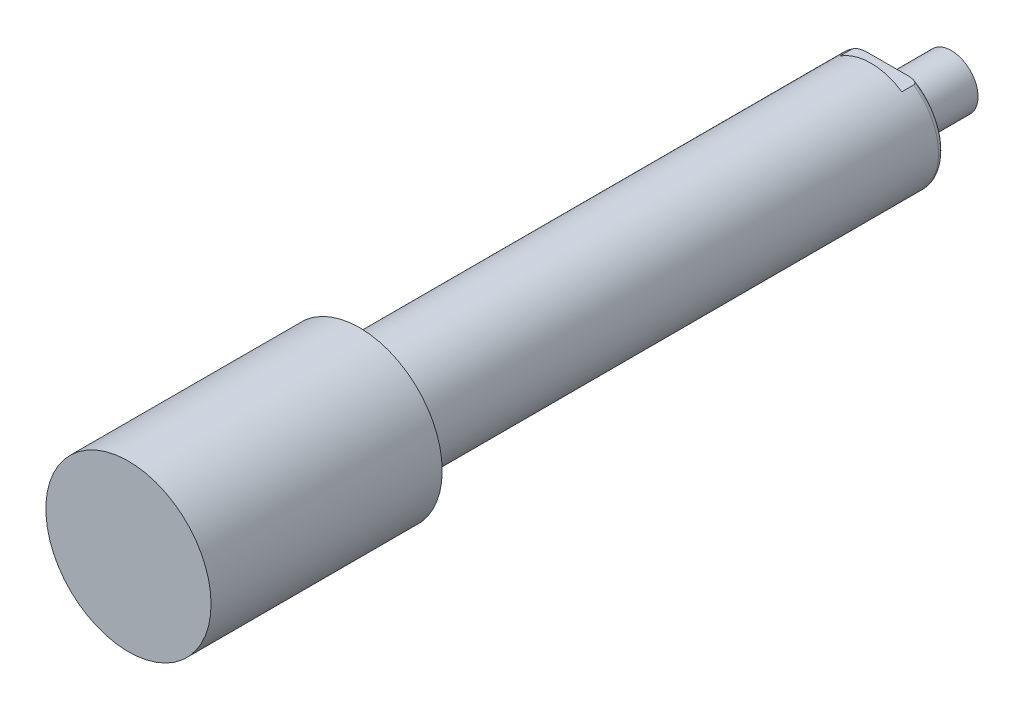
ISO-10303-21;
HEADER;
FILE_DESCRIPTION(('STEP AP214'),'2;1');
FILE_NAME('part.step','',(''),(''),'','','');
FILE_SCHEMA(('AUTOMOTIVE_DESIGN { 1 0 10303 214 1 1 1 1 }'));
ENDSEC;
DATA;
#1=APPLICATION_CONTEXT('core data for automotive mechanical design processes');
#2=APPLICATION_PROTOCOL_DEFINITION('international standard','automotive_design',2000,#1);
#3=PRODUCT_CONTEXT('',#1,'mechanical');
#4=PRODUCT('Part','Part','',(#3));
#5=PRODUCT_RELATED_PRODUCT_CATEGORY('part','',(#4));
#6=PRODUCT_DEFINITION_FORMATION('','',#4);
#7=PRODUCT_DEFINITION_CONTEXT('part definition',#1,'design');
#8=PRODUCT_DEFINITION('design','',#6,#7);
#9=PRODUCT_DEFINITION_SHAPE('','',#8);
#10=(LENGTH_UNIT() NAMED_UNIT(*) SI_UNIT(.MILLI.,.METRE.));
#11=(NAMED_UNIT(*) PLANE_ANGLE_UNIT() SI_UNIT($,.RADIAN.));
#12=(NAMED_UNIT(*) SI_UNIT($,.STERADIAN.) SOLID_ANGLE_UNIT());
#13=UNCERTAINTY_MEASURE_WITH_UNIT(LENGTH_MEASURE(1.E-05),#10,'distance_accuracy_value','');
#14=(GEOMETRIC_REPRESENTATION_CONTEXT(3) GLOBAL_UNCERTAINTY_ASSIGNED_CONTEXT((#13)) GLOBAL_UNIT_ASSIGNED_CONTEXT((#10,
#11,#12)) REPRESENTATION_CONTEXT('',''));
#15=CARTESIAN_POINT('',(0.,0.,0.));
#16=DIRECTION('',(0.,0.,1.));
#17=DIRECTION('',(1.,0.,0.));
#18=AXIS2_PLACEMENT_3D('',#15,#16,#17);
#19=CARTESIAN_POINT('',(0.,0.,41.62));
#20=DIRECTION('',(0.,0.,1.));
#21=DIRECTION('',(1.,0.,0.));
#22=AXIS2_PLACEMENT_3D('',#19,#20,#21);
#23=PLANE('',#22);
#24=CARTESIAN_POINT('',(0.,0.,41.62));
#25=DIRECTION('',(0.,0.,1.));
#26=DIRECTION('',(1.,0.,0.));
#27=AXIS2_PLACEMENT_3D('',#24,#25,#26);
#28=CIRCLE('',#27,24.765);
#29=CARTESIAN_POINT('',(24.765,0.,41.62));
#30=VERTEX_POINT('',#29);
#31=EDGE_CURVE('E149',#30,#30,#28,.T.);
#32=ORIENTED_EDGE('',*,*,#31,.T.);
#33=EDGE_LOOP('',(#32));
#34=FACE_BOUND('',#33,.T.);
#35=ADVANCED_FACE('F16',(#34),#23,.T.);
#36=CARTESIAN_POINT('',(0.,0.,13.045));
#37=DIRECTION('',(0.,0.,1.));
#38=DIRECTION('',(1.,0.,0.));
#39=AXIS2_PLACEMENT_3D('',#36,#37,#38);
#40=CYLINDRICAL_SURFACE('',#39,24.765);
#41=CARTESIAN_POINT('',(0.,0.,-27.686));
#42=DIRECTION('',(0.,0.,-1.));
#43=DIRECTION('',(-1.,0.,0.));
#44=AXIS2_PLACEMENT_3D('',#41,#42,#43);
#45=CIRCLE('',#44,24.765);
#46=CARTESIAN_POINT('',(-24.765,0.,-27.686));
#47=VERTEX_POINT('',#46);
#48=EDGE_CURVE('E151',#47,#47,#45,.T.);
#49=ORIENTED_EDGE('',*,*,#48,.F.);
#50=EDGE_LOOP('',(#49));
#51=FACE_BOUND('',#50,.T.);
#52=ORIENTED_EDGE('',*,*,#31,.F.);
#53=EDGE_LOOP('',(#52));
#54=FACE_BOUND('',#53,.T.);
#55=ADVANCED_FACE('F18',(#51,#54),#40,.T.);
#56=CARTESIAN_POINT('',(0.,0.,-27.686));
#57=DIRECTION('',(0.,0.,-1.));
#58=DIRECTION('',(-1.,0.,0.));
#59=AXIS2_PLACEMENT_3D('',#56,#57,#58);
#60=PLANE('',#59);
#61=CARTESIAN_POINT('',(0.,0.,-27.686));
#62=DIRECTION('',(0.,0.,-1.));
#63=DIRECTION('',(-1.,0.,0.));
#64=AXIS2_PLACEMENT_3D('',#61,#62,#63);
#65=CIRCLE('',#64,16.8);
#66=CARTESIAN_POINT('',(-16.8,0.,-27.686));
#67=VERTEX_POINT('',#66);
#68=EDGE_CURVE('E20',#67,#67,#65,.F.);
#69=ORIENTED_EDGE('',*,*,#68,.T.);
#70=EDGE_LOOP('',(#69));
#71=FACE_BOUND('',#70,.T.);
#72=ORIENTED_EDGE('',*,*,#48,.T.);
#73=EDGE_LOOP('',(#72));
#74=FACE_BOUND('',#73,.T.);
#75=ADVANCED_FACE('F158',(#71,#74),#60,.T.);
#76=CARTESIAN_POINT('',(0.,8.,-205.11539999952));
#77=DIRECTION('',(0.,0.,-1.));
#78=DIRECTION('',(-1.,0.,0.));
#79=AXIS2_PLACEMENT_3D('',#76,#77,#78);
#80=PLANE('',#79);
#81=CARTESIAN_POINT('',(0.,0.,-205.11539999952));
#82=DIRECTION('',(0.,0.,-1.));
#83=DIRECTION('',(-1.,0.,0.));
#84=AXIS2_PLACEMENT_3D('',#81,#82,#83);
#85=CIRCLE('',#84,8.);
#86=CARTESIAN_POINT('',(-8.,0.,-205.11539999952));
#87=VERTEX_POINT('',#86);
#88=EDGE_CURVE('E129',#87,#87,#85,.T.);
#89=ORIENTED_EDGE('',*,*,#88,.T.);
#90=EDGE_LOOP('',(#89));
#91=FACE_BOUND('',#90,.T.);
#92=ADVANCED_FACE('F117',(#91),#80,.T.);
#93=CARTESIAN_POINT('',(0.,0.,-205.11539999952));
#94=DIRECTION('',(0.,0.,-1.));
#95=DIRECTION('',(-1.,0.,0.));
#96=AXIS2_PLACEMENT_3D('',#93,#94,#95);
#97=CYLINDRICAL_SURFACE('',#96,8.);
#98=CARTESIAN_POINT('',(0.,0.,-188.60539999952));
#99=DIRECTION('',(0.,0.,-1.));
#100=DIRECTION('',(-1.,0.,0.));
#101=AXIS2_PLACEMENT_3D('',#98,#99,#100);
#102=CIRCLE('',#101,8.);
#103=CARTESIAN_POINT('',(-8.,0.,-188.60539999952));
#104=VERTEX_POINT('',#103);
#105=EDGE_CURVE('E132',#104,#104,#102,.T.);
#106=ORIENTED_EDGE('',*,*,#105,.T.);
#107=EDGE_LOOP('',(#106));
#108=FACE_BOUND('',#107,.T.);
#109=ORIENTED_EDGE('',*,*,#88,.F.);
#110=EDGE_LOOP('',(#109));
#111=FACE_BOUND('',#110,.T.);
#112=ADVANCED_FACE('F168',(#108,#111),#97,.T.);
#113=CARTESIAN_POINT('',(0.,6.858,-188.60539999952));
#114=DIRECTION('',(0.,0.,1.));
#115=DIRECTION('',(1.,0.,0.));
#116=AXIS2_PLACEMENT_3D('',#113,#114,#115);
#117=PLANE('',#116);
#118=CARTESIAN_POINT('',(0.,0.,-188.60539999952));
#119=DIRECTION('',(0.,0.,-1.));
#120=DIRECTION('',(-1.,0.,0.));
#121=AXIS2_PLACEMENT_3D('',#118,#119,#120);
#122=CIRCLE('',#121,6.858);
#123=CARTESIAN_POINT('',(-6.858,0.,-188.60539999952));
#124=VERTEX_POINT('',#123);
#125=EDGE_CURVE('E135',#124,#124,#122,.T.);
#126=ORIENTED_EDGE('',*,*,#125,.T.);
#127=EDGE_LOOP('',(#126));
#128=FACE_BOUND('',#127,.T.);
#129=ORIENTED_EDGE('',*,*,#105,.F.);
#130=EDGE_LOOP('',(#129));
#131=FACE_BOUND('',#130,.T.);
#132=ADVANCED_FACE('F175',(#128,#131),#117,.T.);
#133=CARTESIAN_POINT('',(0.,0.,-205.11539999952));
#134=DIRECTION('',(0.,0.,-1.));
#135=DIRECTION('',(-1.,0.,0.));
#136=AXIS2_PLACEMENT_3D('',#133,#134,#135);
#137=CYLINDRICAL_SURFACE('',#136,6.858);
#138=CARTESIAN_POINT('',(0.,0.,-186.06539999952));
#139=DIRECTION('',(0.,0.,-1.));
#140=DIRECTION('',(-1.,0.,0.));
#141=AXIS2_PLACEMENT_3D('',#138,#139,#140);
#142=CIRCLE('',#141,6.858);
#143=CARTESIAN_POINT('',(-6.858,0.,-186.06539999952));
#144=VERTEX_POINT('',#143);
#145=EDGE_CURVE('E138',#144,#144,#142,.T.);
#146=ORIENTED_EDGE('',*,*,#145,.T.);
#147=EDGE_LOOP('',(#146));
#148=FACE_BOUND('',#147,.T.);
#149=ORIENTED_EDGE('',*,*,#125,.F.);
#150=EDGE_LOOP('',(#149));
#151=FACE_BOUND('',#150,.T.);
#152=ADVANCED_FACE('F239',(#148,#151),#137,.T.);
#153=CARTESIAN_POINT('',(0.,15.2125,-186.06539999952));
#154=DIRECTION('',(0.,0.,-1.));
#155=DIRECTION('',(-1.,0.,0.));
#156=AXIS2_PLACEMENT_3D('',#153,#154,#155);
#157=PLANE('',#156);
#158=DIRECTION('',(-1.,0.,0.));
#159=VECTOR('',#158,1.);
#160=CARTESIAN_POINT('',(0.,14.,-186.06539999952));
#161=LINE('',#160,#159);
#162=CARTESIAN_POINT('',(5.95148353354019,14.,-186.06539999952));
#163=VERTEX_POINT('',#162);
#164=CARTESIAN_POINT('',(-5.95148353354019,14.,-186.06539999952));
#165=VERTEX_POINT('',#164);
#166=EDGE_CURVE('E10',#163,#165,#161,.T.);
#167=ORIENTED_EDGE('',*,*,#166,.F.);
#168=CARTESIAN_POINT('',(0.,0.,-186.06539999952));
#169=DIRECTION('',(0.,0.,-1.));
#170=DIRECTION('',(-1.,0.,0.));
#171=AXIS2_PLACEMENT_3D('',#168,#169,#170);
#172=CIRCLE('',#171,15.2125);
#173=CARTESIAN_POINT('',(5.95148353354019,-14.,-186.06539999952));
#174=VERTEX_POINT('',#173);
#175=EDGE_CURVE('E141',#163,#174,#172,.T.);
#176=ORIENTED_EDGE('',*,*,#175,.T.);
#177=DIRECTION('',(1.,0.,0.));
#178=VECTOR('',#177,1.);
#179=CARTESIAN_POINT('',(0.,-14.,-186.06539999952));
#180=LINE('',#179,#178);
#181=CARTESIAN_POINT('',(-5.95148353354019,-14.,-186.06539999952));
#182=VERTEX_POINT('',#181);
#183=EDGE_CURVE('E25',#182,#174,#180,.T.);
#184=ORIENTED_EDGE('',*,*,#183,.F.);
#185=EDGE_CURVE('E142',#182,#165,#172,.T.);
#186=ORIENTED_EDGE('',*,*,#185,.T.);
#187=EDGE_LOOP('',(#167,#176,#184,#186));
#188=FACE_BOUND('',#187,.T.);
#189=ORIENTED_EDGE('',*,*,#145,.F.);
#190=EDGE_LOOP('',(#189));
#191=FACE_BOUND('',#190,.T.);
#192=ADVANCED_FACE('F247',(#188,#191),#157,.T.);
#193=CARTESIAN_POINT('',(0.,0.,-180.98539999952));
#194=DIRECTION('',(0.,0.,-1.));
#195=DIRECTION('',(-1.,0.,0.));
#196=AXIS2_PLACEMENT_3D('',#193,#194,#195);
#197=PLANE('',#196);
#198=CARTESIAN_POINT('',(0.,0.,-180.98539999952));
#199=DIRECTION('',(0.,0.,-1.));
#200=DIRECTION('',(-1.,0.,0.));
#201=AXIS2_PLACEMENT_3D('',#198,#199,#200);
#202=CIRCLE('',#201,16.8);
#203=CARTESIAN_POINT('',(-9.28654941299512,14.,-180.98539999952));
#204=VERTEX_POINT('',#203);
#205=CARTESIAN_POINT('',(9.28654941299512,14.,-180.98539999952));
#206=VERTEX_POINT('',#205);
#207=EDGE_CURVE('E71',#204,#206,#202,.T.);
#208=ORIENTED_EDGE('',*,*,#207,.T.);
#209=DIRECTION('',(-1.,0.,0.));
#210=VECTOR('',#209,1.);
#211=CARTESIAN_POINT('',(9.28654941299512,14.,-180.98539999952));
#212=LINE('',#211,#210);
#213=EDGE_CURVE('E74',#206,#204,#212,.T.);
#214=ORIENTED_EDGE('',*,*,#213,.T.);
#215=EDGE_LOOP('',(#208,#214));
#216=FACE_BOUND('',#215,.T.);
#217=ADVANCED_FACE('F73',(#216),#197,.T.);
#218=CARTESIAN_POINT('',(0.,0.,-184.47789999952));
#219=DIRECTION('',(0.,0.,-1.));
#220=DIRECTION('',(-1.,0.,0.));
#221=AXIS2_PLACEMENT_3D('',#218,#219,#220);
#222=TOROIDAL_SURFACE('',#221,15.2125,1.5875);
#223=CARTESIAN_POINT('',(0.,14.,-185.502595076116));
#224=CARTESIAN_POINT('',(-0.132768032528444,14.,-185.502593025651));
#225=CARTESIAN_POINT('',(-0.265533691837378,14.,-185.504844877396));
#226=CARTESIAN_POINT('',(-0.530924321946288,14.,-185.513671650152));
#227=CARTESIAN_POINT('',(-0.663549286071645,14.,-185.520246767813));
#228=CARTESIAN_POINT('',(-1.06113740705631,14.,-185.54582076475));
#229=CARTESIAN_POINT('',(-1.32572041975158,14.,-185.570667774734));
#230=CARTESIAN_POINT('',(-1.85467558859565,14.,-185.630304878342));
#231=CARTESIAN_POINT('',(-2.11904315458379,14.,-185.66513225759));
#232=CARTESIAN_POINT('',(-2.64722640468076,14.,-185.738362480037));
#233=CARTESIAN_POINT('',(-2.91104215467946,14.,-185.77676486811));
#234=CARTESIAN_POINT('',(-3.34668840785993,14.,-185.838564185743));
#235=CARTESIAN_POINT('',(-3.51843693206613,14.,-185.8625139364));
#236=CARTESIAN_POINT('',(-3.86222256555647,14.,-185.908226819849));
#237=CARTESIAN_POINT('',(-4.03425968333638,14.,-185.929989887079));
#238=CARTESIAN_POINT('',(-4.55096879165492,14.,-185.990020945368));
#239=CARTESIAN_POINT('',(-4.89633775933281,14.,-186.023046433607));
#240=CARTESIAN_POINT('',(-5.4324845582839,14.,-186.054635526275));
#241=CARTESIAN_POINT('',(-5.6227161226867,14.,-186.062024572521));
#242=CARTESIAN_POINT('',(-6.0034249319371,14.,-186.066964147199));
#243=CARTESIAN_POINT('',(-6.19390224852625,14.,-186.064510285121));
#244=CARTESIAN_POINT('',(-6.57443040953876,14.,-186.04706589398));
#245=CARTESIAN_POINT('',(-6.76448114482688,14.,-186.032072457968));
#246=CARTESIAN_POINT('',(-7.04800150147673,14.,-185.997528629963));
#247=CARTESIAN_POINT('',(-7.14221305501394,14.,-185.984012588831));
#248=CARTESIAN_POINT('',(-7.32985530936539,14.,-185.952394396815));
#249=CARTESIAN_POINT('',(-7.42328618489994,14.,-185.934293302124));
#250=CARTESIAN_POINT('',(-7.60981224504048,14.,-185.892657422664));
#251=CARTESIAN_POINT('',(-7.70289714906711,14.,-185.869075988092));
#252=CARTESIAN_POINT('',(-7.88726094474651,14.,-185.81574825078));
#253=CARTESIAN_POINT('',(-7.97854070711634,14.,-185.7860050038));
#254=CARTESIAN_POINT('',(-8.15800808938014,14.,-185.719496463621));
#255=CARTESIAN_POINT('',(-8.24620915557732,14.,-185.682767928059));
#256=CARTESIAN_POINT('',(-8.41861308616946,14.,-185.600991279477));
#257=CARTESIAN_POINT('',(-8.50282110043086,14.,-185.555954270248));
#258=CARTESIAN_POINT('',(-8.64739637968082,14.,-185.467038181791));
#259=CARTESIAN_POINT('',(-8.70893575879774,14.,-185.425080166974));
#260=CARTESIAN_POINT('',(-8.82695536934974,14.,-185.334330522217));
#261=CARTESIAN_POINT('',(-8.88342980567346,14.,-185.285531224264));
#262=CARTESIAN_POINT('',(-8.98963579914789,14.,-185.179856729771));
#263=CARTESIAN_POINT('',(-9.03928619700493,14.,-185.122898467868));
#264=CARTESIAN_POINT('',(-9.12777987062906,14.,-185.00111166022));
#265=CARTESIAN_POINT('',(-9.16665238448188,14.,-184.93630510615));
#266=CARTESIAN_POINT('',(-9.22003745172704,14.,-184.820711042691));
#267=CARTESIAN_POINT('',(-9.23836397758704,14.,-184.771688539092));
#268=CARTESIAN_POINT('',(-9.26663253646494,14.,-184.671274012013));
#269=CARTESIAN_POINT('',(-9.27658176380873,14.,-184.619884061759));
#270=CARTESIAN_POINT('',(-9.28727482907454,14.,-184.51594216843));
#271=CARTESIAN_POINT('',(-9.28798383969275,14.,-184.46338657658));
#272=CARTESIAN_POINT('',(-9.28004044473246,14.,-184.35898713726));
#273=CARTESIAN_POINT('',(-9.27138562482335,14.,-184.307143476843));
#274=CARTESIAN_POINT('',(-9.24609238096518,14.,-184.208096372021));
#275=CARTESIAN_POINT('',(-9.22985055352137,14.,-184.160789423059));
#276=CARTESIAN_POINT('',(-9.19066177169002,14.,-184.069071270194));
#277=CARTESIAN_POINT('',(-9.16771223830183,14.,-184.024661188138));
#278=CARTESIAN_POINT('',(-9.10285320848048,14.,-183.916841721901));
#279=CARTESIAN_POINT('',(-9.05730159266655,14.,-183.855624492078));
#280=CARTESIAN_POINT('',(-8.95711629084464,14.,-183.7411387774));
#281=CARTESIAN_POINT('',(-8.90245884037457,14.,-183.687891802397));
#282=CARTESIAN_POINT('',(-8.75205778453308,14.,-183.558960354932));
#283=CARTESIAN_POINT('',(-8.65138838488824,14.,-183.489065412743));
#284=CARTESIAN_POINT('',(-8.44094705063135,14.,-183.364906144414));
#285=CARTESIAN_POINT('',(-8.3311545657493,14.,-183.310678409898));
#286=CARTESIAN_POINT('',(-8.11312892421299,14.,-183.217886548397));
#287=CARTESIAN_POINT('',(-8.00521018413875,14.,-183.178567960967));
#288=CARTESIAN_POINT('',(-7.78638225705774,14.,-183.109218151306));
#289=CARTESIAN_POINT('',(-7.67547044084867,14.,-183.07919540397));
#290=CARTESIAN_POINT('',(-7.45172845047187,14.,-183.02694530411));
#291=CARTESIAN_POINT('',(-7.33889625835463,14.,-183.004726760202));
#292=CARTESIAN_POINT('',(-7.11210332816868,14.,-182.966935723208));
#293=CARTESIAN_POINT('',(-6.99814217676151,14.,-182.951365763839));
#294=CARTESIAN_POINT('',(-6.76357841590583,14.,-182.925250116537));
#295=CARTESIAN_POINT('',(-6.64294221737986,14.,-182.915012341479));
#296=CARTESIAN_POINT('',(-6.40132401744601,14.,-182.899929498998));
#297=CARTESIAN_POINT('',(-6.2803419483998,14.,-182.89508557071));
#298=CARTESIAN_POINT('',(-5.91706739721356,14.,-182.887460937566));
#299=CARTESIAN_POINT('',(-5.67462782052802,14.,-182.891605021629));
#300=CARTESIAN_POINT('',(-5.18958172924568,14.,-182.913383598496));
#301=CARTESIAN_POINT('',(-4.94697788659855,14.,-182.931067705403));
#302=CARTESIAN_POINT('',(-4.4628147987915,14.,-182.975899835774));
#303=CARTESIAN_POINT('',(-4.22125506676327,14.,-183.00304282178));
#304=CARTESIAN_POINT('',(-3.66652722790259,14.,-183.072108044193));
#305=CARTESIAN_POINT('',(-3.35361868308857,14.,-183.11602115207));
#306=CARTESIAN_POINT('',(-2.72786060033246,14.,-183.20538682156));
#307=CARTESIAN_POINT('',(-2.41501121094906,14.,-183.250840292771));
#308=CARTESIAN_POINT('',(-1.79091906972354,14.,-183.333284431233));
#309=CARTESIAN_POINT('',(-1.47968696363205,14.,-183.370347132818));
#310=CARTESIAN_POINT('',(-1.01173384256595,14.,-183.412283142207));
#311=CARTESIAN_POINT('',(-0.855647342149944,14.,-183.423982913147));
#312=CARTESIAN_POINT('',(-0.543154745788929,14.,-183.441808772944));
#313=CARTESIAN_POINT('',(-0.386748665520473,14.,-183.447935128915));
#314=CARTESIAN_POINT('',(-0.0729452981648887,14.,-183.454018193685));
#315=CARTESIAN_POINT('',(0.0844526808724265,14.,-183.453940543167));
#316=CARTESIAN_POINT('',(0.399120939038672,14.,-183.447538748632));
#317=CARTESIAN_POINT('',(0.556391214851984,14.,-183.441214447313));
#318=CARTESIAN_POINT('',(0.870747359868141,14.,-183.422945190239));
#319=CARTESIAN_POINT('',(1.02783290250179,14.,-183.410994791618));
#320=CARTESIAN_POINT('',(1.34159739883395,14.,-183.382550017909));
#321=CARTESIAN_POINT('',(1.49827630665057,14.,-183.366055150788));
#322=CARTESIAN_POINT('',(1.81316576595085,14.,-183.329583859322));
#323=CARTESIAN_POINT('',(1.97137154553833,14.,-183.309567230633));
#324=CARTESIAN_POINT('',(2.28750928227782,14.,-183.267537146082));
#325=CARTESIAN_POINT('',(2.4454412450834,14.,-183.245523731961));
#326=CARTESIAN_POINT('',(2.91891159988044,14.,-183.178449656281));
#327=CARTESIAN_POINT('',(3.23429351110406,14.,-183.132332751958));
#328=CARTESIAN_POINT('',(3.86696922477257,14.,-183.046141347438));
#329=CARTESIAN_POINT('',(4.18426592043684,14.,-183.00608632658));
#330=CARTESIAN_POINT('',(4.66160221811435,14.,-182.956907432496));
#331=CARTESIAN_POINT('',(4.82106369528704,14.,-182.942325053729));
#332=CARTESIAN_POINT('',(5.1403435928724,14.,-182.917922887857));
#333=CARTESIAN_POINT('',(5.30016197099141,14.,-182.908102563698));
#334=CARTESIAN_POINT('',(5.61795638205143,14.,-182.894521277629));
#335=CARTESIAN_POINT('',(5.77592887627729,14.,-182.890682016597));
#336=CARTESIAN_POINT('',(6.09195057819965,14.,-182.89014758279));
#337=CARTESIAN_POINT('',(6.24999979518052,14.,-182.893454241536));
#338=CARTESIAN_POINT('',(6.56527224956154,14.,-182.908786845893));
#339=CARTESIAN_POINT('',(6.72249656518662,14.,-182.920789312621));
#340=CARTESIAN_POINT('',(7.03573124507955,14.,-182.955441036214));
#341=CARTESIAN_POINT('',(7.1917424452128,14.,-182.978082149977));
#342=CARTESIAN_POINT('',(7.41615197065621,14.,-183.020489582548));
#343=CARTESIAN_POINT('',(7.4855571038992,14.,-183.034991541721));
#344=CARTESIAN_POINT('',(7.62369369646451,14.,-183.066975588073));
#345=CARTESIAN_POINT('',(7.69242507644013,14.,-183.084458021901));
#346=CARTESIAN_POINT('',(7.82924857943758,14.,-183.122814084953));
#347=CARTESIAN_POINT('',(7.89733687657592,14.,-183.143701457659));
#348=CARTESIAN_POINT('',(8.0322578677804,14.,-183.189211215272));
#349=CARTESIAN_POINT('',(8.09909066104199,14.,-183.213833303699));
#350=CARTESIAN_POINT('',(8.23194606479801,14.,-183.267631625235));
#351=CARTESIAN_POINT('',(8.29794618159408,14.,-183.296863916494));
#352=CARTESIAN_POINT('',(8.42761843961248,14.,-183.360218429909));
#353=CARTESIAN_POINT('',(8.49128951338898,14.,-183.394342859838));
#354=CARTESIAN_POINT('',(8.61506191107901,14.,-183.46792848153));
#355=CARTESIAN_POINT('',(8.67517993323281,14.,-183.507361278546));
#356=CARTESIAN_POINT('',(8.79087032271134,14.,-183.592343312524));
#357=CARTESIAN_POINT('',(8.8464489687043,14.,-183.637883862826));
#358=CARTESIAN_POINT('',(8.94548291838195,14.,-183.730317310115));
#359=CARTESIAN_POINT('',(8.98959902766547,14.,-183.776494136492));
#360=CARTESIAN_POINT('',(9.071127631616,14.,-183.874534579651));
#361=CARTESIAN_POINT('',(9.10853908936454,14.,-183.926399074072));
#362=CARTESIAN_POINT('',(9.17478487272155,14.,-184.036313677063));
#363=CARTESIAN_POINT('',(9.20351043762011,14.,-184.094430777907));
#364=CARTESIAN_POINT('',(9.24908813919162,14.,-184.215152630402));
#365=CARTESIAN_POINT('',(9.26596285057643,14.,-184.277748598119));
#366=CARTESIAN_POINT('',(9.28464960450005,14.,-184.397335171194));
#367=CARTESIAN_POINT('',(9.28804963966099,14.,-184.4540766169));
#368=CARTESIAN_POINT('',(9.28382966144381,14.,-184.567145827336));
#369=CARTESIAN_POINT('',(9.27621073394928,14.,-184.623473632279));
#370=CARTESIAN_POINT('',(9.25229003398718,14.,-184.727102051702));
#371=CARTESIAN_POINT('',(9.23713577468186,14.,-184.774676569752));
#372=CARTESIAN_POINT('',(9.19997892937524,14.,-184.867038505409));
#373=CARTESIAN_POINT('',(9.17797466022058,14.,-184.911825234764));
#374=CARTESIAN_POINT('',(9.11609014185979,14.,-185.019302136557));
#375=CARTESIAN_POINT('',(9.07273694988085,14.,-185.079990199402));
#376=CARTESIAN_POINT('',(8.97697606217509,14.,-185.193741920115));
#377=CARTESIAN_POINT('',(8.92454537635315,14.,-185.246785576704));
#378=CARTESIAN_POINT('',(8.78073012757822,14.,-185.374735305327));
#379=CARTESIAN_POINT('',(8.68454281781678,14.,-185.444202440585));
#380=CARTESIAN_POINT('',(8.48303059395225,14.,-185.568115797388));
#381=CARTESIAN_POINT('',(8.37768429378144,14.,-185.622525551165));
#382=CARTESIAN_POINT('',(8.16908427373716,14.,-185.715673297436));
#383=CARTESIAN_POINT('',(8.06619117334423,14.,-185.755235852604));
#384=CARTESIAN_POINT('',(7.85737031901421,14.,-185.825483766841));
#385=CARTESIAN_POINT('',(7.75143986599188,14.,-185.856160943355));
#386=CARTESIAN_POINT('',(7.53762663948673,14.,-185.910024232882));
#387=CARTESIAN_POINT('',(7.42974224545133,14.,-185.933203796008));
#388=CARTESIAN_POINT('',(7.21287186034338,14.,-185.973141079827));
#389=CARTESIAN_POINT('',(7.10388648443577,14.,-185.989902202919));
#390=CARTESIAN_POINT('',(6.89130219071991,14.,-186.017143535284));
#391=CARTESIAN_POINT('',(6.78774054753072,14.,-186.027921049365));
#392=CARTESIAN_POINT('',(6.5802549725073,14.,-186.045196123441));
#393=CARTESIAN_POINT('',(6.47633098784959,14.,-186.051693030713));
#394=CARTESIAN_POINT('',(6.16416768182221,14.,-186.065589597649));
#395=CARTESIAN_POINT('',(5.95567421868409,14.,-186.067379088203));
#396=CARTESIAN_POINT('',(5.53835436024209,14.,-186.05950473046));
#397=CARTESIAN_POINT('',(5.32952888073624,14.,-186.049806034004));
#398=CARTESIAN_POINT('',(4.91243398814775,14.,-186.021724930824));
#399=CARTESIAN_POINT('',(4.7041647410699,14.,-186.003340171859));
#400=CARTESIAN_POINT('',(4.28654719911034,14.,-185.960186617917));
#401=CARTESIAN_POINT('',(4.07720452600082,14.,-185.935365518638));
#402=CARTESIAN_POINT('',(3.65905089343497,14.,-185.881814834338));
#403=CARTESIAN_POINT('',(3.4502398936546,14.,-185.853085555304));
#404=CARTESIAN_POINT('',(3.03316786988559,14.,-185.794210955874));
#405=CARTESIAN_POINT('',(2.82490650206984,14.,-185.764067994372));
#406=CARTESIAN_POINT('',(2.40822602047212,14.,-185.704971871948));
#407=CARTESIAN_POINT('',(2.19980692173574,14.,-185.676018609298));
#408=CARTESIAN_POINT('',(1.82558056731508,14.,-185.627810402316));
#409=CARTESIAN_POINT('',(1.65987471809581,14.,-185.607788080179));
#410=CARTESIAN_POINT('',(1.32795613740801,14.,-185.571904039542));
#411=CARTESIAN_POINT('',(1.16174328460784,14.,-185.556043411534));
#412=CARTESIAN_POINT('',(0.829734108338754,14.,-185.530025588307));
#413=CARTESIAN_POINT('',(0.663940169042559,14.,-185.519838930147));
#414=CARTESIAN_POINT('',(0.332096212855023,14.,-185.506125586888));
#415=CARTESIAN_POINT('',(0.166046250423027,14.,-185.502597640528));
#416=CARTESIAN_POINT('',(0.,14.,-185.502595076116));
#417=B_SPLINE_CURVE_WITH_KNOTS('',3,(#223,#224,#225,#226,#227,#228,#229,#230,#231,#232,#233,
#234,#235,#236,#237,#238,#239,#240,#241,#242,#243,#244,#245,#246,#247,#248,#249,#250,#251,#252,
#253,#254,#255,#256,#257,#258,#259,#260,#261,#262,#263,#264,#265,#266,#267,#268,#269,#270,#271,
#272,#273,#274,#275,#276,#277,#278,#279,#280,#281,#282,#283,#284,#285,#286,#287,#288,#289,#290,
#291,#292,#293,#294,#295,#296,#297,#298,#299,#300,#301,#302,#303,#304,#305,#306,#307,#308,#309,
#310,#311,#312,#313,#314,#315,#316,#317,#318,#319,#320,#321,#322,#323,#324,#325,#326,#327,#328,
#329,#330,#331,#332,#333,#334,#335,#336,#337,#338,#339,#340,#341,#342,#343,#344,#345,#346,#347,
#348,#349,#350,#351,#352,#353,#354,#355,#356,#357,#358,#359,#360,#361,#362,#363,#364,#365,#366,
#367,#368,#369,#370,#371,#372,#373,#374,#375,#376,#377,#378,#379,#380,#381,#382,#383,#384,#385,
#386,#387,#388,#389,#390,#391,#392,#393,#394,#395,#396,#397,#398,#399,#400,#401,#402,#403,#404,
#405,#406,#407,#408,#409,#410,#411,#412,#413,#414,#415,#416),.UNSPECIFIED.,.T.,.F.,(4,2,2,2,2,2,
2,2,2,2,2,2,2,2,2,2,2,2,2,2,2,2,2,2,2,2,2,2,2,2,2,2,2,2,2,2,2,2,2,2,2,2,2,2,2,2,2,2,2,2,2,2,2,2,
2,2,2,2,2,2,2,2,2,2,2,2,2,2,2,2,2,2,2,2,2,2,2,2,2,2,2,2,2,2,2,2,2,2,2,2,2,2,2,2,2,2,4),(0.,
0.398281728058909,0.796581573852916,1.59346088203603,2.39335695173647,3.19315132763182,
3.71336857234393,4.23360141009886,5.27376582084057,5.84469365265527,6.41587617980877,
6.98719115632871,7.27262913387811,7.55800141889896,7.84589809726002,8.13365234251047,
8.41993230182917,8.70583240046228,8.92889552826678,9.1522107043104,9.37798665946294,
9.60314400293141,9.7595209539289,9.91576347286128,10.0725947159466,10.2294664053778,
10.378925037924,10.5284412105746,10.7560526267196,10.9842676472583,11.3498680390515,
11.7163155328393,12.0603788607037,12.4047549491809,12.7495184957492,13.094413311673,
13.4574784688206,13.8206202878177,14.5474486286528,15.276953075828,16.0060696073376,
16.9539379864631,17.9023761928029,18.8423341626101,19.3118216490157,19.7812866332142,
20.2533518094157,20.7254288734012,21.1979635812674,21.6705494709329,22.1489292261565,
22.6272989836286,23.5835269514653,24.5427652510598,25.0230897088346,25.5033599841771,
25.9772884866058,26.451338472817,26.9241132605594,27.3965267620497,27.609186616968,
27.8218712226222,28.0354365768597,28.2489849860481,28.4653650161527,28.6818430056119,
28.8972059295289,29.1122657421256,29.3033629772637,29.4944897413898,29.6879190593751,
29.8809789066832,30.0504588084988,30.2199220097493,30.3691164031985,30.518347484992,
30.7408251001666,30.963874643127,31.3178265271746,31.6726282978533,32.0028505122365,
32.3333758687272,32.6641891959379,32.9948269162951,33.3070886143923,33.6193979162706,
34.2444298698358,34.871362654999,35.4984653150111,36.1308331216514,36.763151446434,
37.3944498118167,38.0256940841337,38.5263936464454,39.0272242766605,39.5254294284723,
40.0235402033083),.UNSPECIFIED.);
#418=CARTESIAN_POINT('',(9.28654941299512,14.,-184.47789999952));
#419=VERTEX_POINT('',#418);
#420=EDGE_CURVE('E32',#419,#163,#417,.T.);
#421=ORIENTED_EDGE('',*,*,#420,.F.);
#422=CARTESIAN_POINT('',(0.,0.,-184.47789999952));
#423=DIRECTION('',(0.,0.,-1.));
#424=DIRECTION('',(-1.,0.,0.));
#425=AXIS2_PLACEMENT_3D('',#422,#423,#424);
#426=CIRCLE('',#425,16.8);
#427=CARTESIAN_POINT('',(9.28654941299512,-14.,-184.47789999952));
#428=VERTEX_POINT('',#427);
#429=EDGE_CURVE('E87',#419,#428,#426,.T.);
#430=ORIENTED_EDGE('',*,*,#429,.T.);
#431=CARTESIAN_POINT('',(0.,-14.,-185.502595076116));
#432=CARTESIAN_POINT('',(0.132768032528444,-14.,-185.502593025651));
#433=CARTESIAN_POINT('',(0.265533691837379,-14.,-185.504844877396));
#434=CARTESIAN_POINT('',(0.53092432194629,-14.,-185.513671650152));
#435=CARTESIAN_POINT('',(0.663549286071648,-14.,-185.520246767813));
#436=CARTESIAN_POINT('',(1.06113740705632,-14.,-185.54582076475));
#437=CARTESIAN_POINT('',(1.32572041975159,-14.,-185.570667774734));
#438=CARTESIAN_POINT('',(1.85467558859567,-14.,-185.630304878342));
#439=CARTESIAN_POINT('',(2.1190431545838,-14.,-185.66513225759));
#440=CARTESIAN_POINT('',(2.64722640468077,-14.,-185.738362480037));
#441=CARTESIAN_POINT('',(2.91104215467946,-14.,-185.77676486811));
#442=CARTESIAN_POINT('',(3.34668840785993,-14.,-185.838564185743));
#443=CARTESIAN_POINT('',(3.51843693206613,-14.,-185.8625139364));
#444=CARTESIAN_POINT('',(3.86222256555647,-14.,-185.908226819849));
#445=CARTESIAN_POINT('',(4.03425968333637,-14.,-185.929989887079));
#446=CARTESIAN_POINT('',(4.55096879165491,-14.,-185.990020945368));
#447=CARTESIAN_POINT('',(4.8963377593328,-14.,-186.023046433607));
#448=CARTESIAN_POINT('',(5.43248455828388,-14.,-186.054635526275));
#449=CARTESIAN_POINT('',(5.62271612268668,-14.,-186.062024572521));
#450=CARTESIAN_POINT('',(6.00342493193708,-14.,-186.066964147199));
#451=CARTESIAN_POINT('',(6.19390224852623,-14.,-186.064510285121));
#452=CARTESIAN_POINT('',(6.57443040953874,-14.,-186.04706589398));
#453=CARTESIAN_POINT('',(6.76448114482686,-14.,-186.032072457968));
#454=CARTESIAN_POINT('',(7.04800150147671,-14.,-185.997528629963));
#455=CARTESIAN_POINT('',(7.14221305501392,-14.,-185.984012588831));
#456=CARTESIAN_POINT('',(7.32985530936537,-14.,-185.952394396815));
#457=CARTESIAN_POINT('',(7.42328618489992,-14.,-185.934293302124));
#458=CARTESIAN_POINT('',(7.60981224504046,-14.,-185.892657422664));
#459=CARTESIAN_POINT('',(7.70289714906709,-14.,-185.869075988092));
#460=CARTESIAN_POINT('',(7.88726094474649,-14.,-185.81574825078));
#461=CARTESIAN_POINT('',(7.97854070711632,-14.,-185.7860050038));
#462=CARTESIAN_POINT('',(8.15800808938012,-14.,-185.719496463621));
#463=CARTESIAN_POINT('',(8.2462091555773,-14.,-185.682767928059));
#464=CARTESIAN_POINT('',(8.41861308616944,-14.,-185.600991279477));
#465=CARTESIAN_POINT('',(8.50282110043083,-14.,-185.555954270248));
#466=CARTESIAN_POINT('',(8.6473963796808,-14.,-185.467038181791));
#467=CARTESIAN_POINT('',(8.70893575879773,-14.,-185.425080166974));
#468=CARTESIAN_POINT('',(8.82695536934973,-14.,-185.334330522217));
#469=CARTESIAN_POINT('',(8.88342980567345,-14.,-185.285531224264));
#470=CARTESIAN_POINT('',(8.98963579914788,-14.,-185.179856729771));
#471=CARTESIAN_POINT('',(9.03928619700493,-14.,-185.122898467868));
#472=CARTESIAN_POINT('',(9.12777987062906,-14.,-185.00111166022));
#473=CARTESIAN_POINT('',(9.16665238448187,-14.,-184.93630510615));
#474=CARTESIAN_POINT('',(9.22003745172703,-14.,-184.820711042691));
#475=CARTESIAN_POINT('',(9.23836397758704,-14.,-184.771688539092));
#476=CARTESIAN_POINT('',(9.26663253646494,-14.,-184.671274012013));
#477=CARTESIAN_POINT('',(9.27658176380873,-14.,-184.619884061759));
#478=CARTESIAN_POINT('',(9.28727482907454,-14.,-184.51594216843));
#479=CARTESIAN_POINT('',(9.28798383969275,-14.,-184.46338657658));
#480=CARTESIAN_POINT('',(9.28004044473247,-14.,-184.35898713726));
#481=CARTESIAN_POINT('',(9.27138562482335,-14.,-184.307143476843));
#482=CARTESIAN_POINT('',(9.24609238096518,-14.,-184.208096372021));
#483=CARTESIAN_POINT('',(9.22985055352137,-14.,-184.160789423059));
#484=CARTESIAN_POINT('',(9.19066177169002,-14.,-184.069071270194));
#485=CARTESIAN_POINT('',(9.16771223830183,-14.,-184.024661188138));
#486=CARTESIAN_POINT('',(9.10285320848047,-14.,-183.916841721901));
#487=CARTESIAN_POINT('',(9.05730159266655,-14.,-183.855624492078));
#488=CARTESIAN_POINT('',(8.95711629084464,-14.,-183.7411387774));
#489=CARTESIAN_POINT('',(8.90245884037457,-14.,-183.687891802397));
#490=CARTESIAN_POINT('',(8.75205778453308,-14.,-183.558960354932));
#491=CARTESIAN_POINT('',(8.65138838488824,-14.,-183.489065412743));
#492=CARTESIAN_POINT('',(8.44094705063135,-14.,-183.364906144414));
#493=CARTESIAN_POINT('',(8.3311545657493,-14.,-183.310678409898));
#494=CARTESIAN_POINT('',(8.11312892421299,-14.,-183.217886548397));
#495=CARTESIAN_POINT('',(8.00521018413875,-14.,-183.178567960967));
#496=CARTESIAN_POINT('',(7.78638225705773,-14.,-183.109218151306));
#497=CARTESIAN_POINT('',(7.67547044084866,-14.,-183.07919540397));
#498=CARTESIAN_POINT('',(7.45172845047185,-14.,-183.02694530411));
#499=CARTESIAN_POINT('',(7.33889625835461,-14.,-183.004726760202));
#500=CARTESIAN_POINT('',(7.11210332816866,-14.,-182.966935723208));
#501=CARTESIAN_POINT('',(6.9981421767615,-14.,-182.951365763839));
#502=CARTESIAN_POINT('',(6.76357841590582,-14.,-182.925250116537));
#503=CARTESIAN_POINT('',(6.64294221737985,-14.,-182.915012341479));
#504=CARTESIAN_POINT('',(6.40132401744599,-14.,-182.899929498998));
#505=CARTESIAN_POINT('',(6.28034194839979,-14.,-182.89508557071));
#506=CARTESIAN_POINT('',(5.91706739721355,-14.,-182.887460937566));
#507=CARTESIAN_POINT('',(5.674627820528,-14.,-182.891605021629));
#508=CARTESIAN_POINT('',(5.18958172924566,-14.,-182.913383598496));
#509=CARTESIAN_POINT('',(4.94697788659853,-14.,-182.931067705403));
#510=CARTESIAN_POINT('',(4.46281479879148,-14.,-182.975899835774));
#511=CARTESIAN_POINT('',(4.22125506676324,-14.,-183.00304282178));
#512=CARTESIAN_POINT('',(3.66652722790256,-14.,-183.072108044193));
#513=CARTESIAN_POINT('',(3.35361868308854,-14.,-183.11602115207));
#514=CARTESIAN_POINT('',(2.72786060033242,-14.,-183.20538682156));
#515=CARTESIAN_POINT('',(2.41501121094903,-14.,-183.250840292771));
#516=CARTESIAN_POINT('',(1.7909190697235,-14.,-183.333284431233));
#517=CARTESIAN_POINT('',(1.47968696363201,-14.,-183.370347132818));
#518=CARTESIAN_POINT('',(1.01173384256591,-14.,-183.412283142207));
#519=CARTESIAN_POINT('',(0.855647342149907,-14.,-183.423982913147));
#520=CARTESIAN_POINT('',(0.54315474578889,-14.,-183.441808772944));
#521=CARTESIAN_POINT('',(0.386748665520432,-14.,-183.447935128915));
#522=CARTESIAN_POINT('',(0.0729452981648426,-14.,-183.454018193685));
#523=CARTESIAN_POINT('',(-0.0844526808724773,-14.,-183.453940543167));
#524=CARTESIAN_POINT('',(-0.399120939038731,-14.,-183.447538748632));
#525=CARTESIAN_POINT('',(-0.556391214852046,-14.,-183.441214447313));
#526=CARTESIAN_POINT('',(-0.870747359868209,-14.,-183.422945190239));
#527=CARTESIAN_POINT('',(-1.02783290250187,-14.,-183.410994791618));
#528=CARTESIAN_POINT('',(-1.34159739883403,-14.,-183.382550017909));
#529=CARTESIAN_POINT('',(-1.49827630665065,-14.,-183.366055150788));
#530=CARTESIAN_POINT('',(-1.81316576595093,-14.,-183.329583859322));
#531=CARTESIAN_POINT('',(-1.97137154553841,-14.,-183.309567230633));
#532=CARTESIAN_POINT('',(-2.28750928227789,-14.,-183.267537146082));
#533=CARTESIAN_POINT('',(-2.44544124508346,-14.,-183.245523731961));
#534=CARTESIAN_POINT('',(-2.91891159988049,-14.,-183.178449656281));
#535=CARTESIAN_POINT('',(-3.23429351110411,-14.,-183.132332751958));
#536=CARTESIAN_POINT('',(-3.86696922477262,-14.,-183.046141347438));
#537=CARTESIAN_POINT('',(-4.18426592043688,-14.,-183.00608632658));
#538=CARTESIAN_POINT('',(-4.66160221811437,-14.,-182.956907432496));
#539=CARTESIAN_POINT('',(-4.82106369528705,-14.,-182.942325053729));
#540=CARTESIAN_POINT('',(-5.14034359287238,-14.,-182.917922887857));
#541=CARTESIAN_POINT('',(-5.30016197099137,-14.,-182.908102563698));
#542=CARTESIAN_POINT('',(-5.61795638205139,-14.,-182.894521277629));
#543=CARTESIAN_POINT('',(-5.77592887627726,-14.,-182.890682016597));
#544=CARTESIAN_POINT('',(-6.09195057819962,-14.,-182.89014758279));
#545=CARTESIAN_POINT('',(-6.24999979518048,-14.,-182.893454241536));
#546=CARTESIAN_POINT('',(-6.56527224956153,-14.,-182.908786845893));
#547=CARTESIAN_POINT('',(-6.72249656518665,-14.,-182.920789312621));
#548=CARTESIAN_POINT('',(-7.03573124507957,-14.,-182.955441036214));
#549=CARTESIAN_POINT('',(-7.19174244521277,-14.,-182.978082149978));
#550=CARTESIAN_POINT('',(-7.4161519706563,-14.,-183.020489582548));
#551=CARTESIAN_POINT('',(-7.48555710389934,-14.,-183.034991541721));
#552=CARTESIAN_POINT('',(-7.62369369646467,-14.,-183.066975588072));
#553=CARTESIAN_POINT('',(-7.69242507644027,-14.,-183.084458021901));
#554=CARTESIAN_POINT('',(-7.82924857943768,-14.,-183.122814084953));
#555=CARTESIAN_POINT('',(-7.89733687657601,-14.,-183.143701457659));
#556=CARTESIAN_POINT('',(-8.03225786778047,-14.,-183.189211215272));
#557=CARTESIAN_POINT('',(-8.09909066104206,-14.,-183.213833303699));
#558=CARTESIAN_POINT('',(-8.23194606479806,-14.,-183.267631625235));
#559=CARTESIAN_POINT('',(-8.29794618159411,-14.,-183.296863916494));
#560=CARTESIAN_POINT('',(-8.4276184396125,-14.,-183.360218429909));
#561=CARTESIAN_POINT('',(-8.491289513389,-14.,-183.394342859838));
#562=CARTESIAN_POINT('',(-8.61506191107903,-14.,-183.46792848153));
#563=CARTESIAN_POINT('',(-8.67517993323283,-14.,-183.507361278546));
#564=CARTESIAN_POINT('',(-8.79087032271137,-14.,-183.592343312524));
#565=CARTESIAN_POINT('',(-8.84644896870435,-14.,-183.637883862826));
#566=CARTESIAN_POINT('',(-8.945482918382,-14.,-183.730317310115));
#567=CARTESIAN_POINT('',(-8.9895990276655,-14.,-183.776494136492));
#568=CARTESIAN_POINT('',(-9.07112763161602,-14.,-183.874534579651));
#569=CARTESIAN_POINT('',(-9.10853908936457,-14.,-183.926399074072));
#570=CARTESIAN_POINT('',(-9.17478487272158,-14.,-184.036313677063));
#571=CARTESIAN_POINT('',(-9.20351043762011,-14.,-184.094430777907));
#572=CARTESIAN_POINT('',(-9.24908813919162,-14.,-184.215152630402));
#573=CARTESIAN_POINT('',(-9.26596285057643,-14.,-184.277748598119));
#574=CARTESIAN_POINT('',(-9.28464960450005,-14.,-184.397335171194));
#575=CARTESIAN_POINT('',(-9.28804963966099,-14.,-184.4540766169));
#576=CARTESIAN_POINT('',(-9.28382966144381,-14.,-184.567145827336));
#577=CARTESIAN_POINT('',(-9.27621073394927,-14.,-184.623473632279));
#578=CARTESIAN_POINT('',(-9.25229003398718,-14.,-184.727102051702));
#579=CARTESIAN_POINT('',(-9.23713577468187,-14.,-184.774676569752));
#580=CARTESIAN_POINT('',(-9.19997892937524,-14.,-184.867038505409));
#581=CARTESIAN_POINT('',(-9.17797466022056,-14.,-184.911825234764));
#582=CARTESIAN_POINT('',(-9.11609014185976,-14.,-185.019302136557));
#583=CARTESIAN_POINT('',(-9.07273694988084,-14.,-185.079990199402));
#584=CARTESIAN_POINT('',(-8.97697606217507,-14.,-185.193741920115));
#585=CARTESIAN_POINT('',(-8.92454537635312,-14.,-185.246785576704));
#586=CARTESIAN_POINT('',(-8.78073012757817,-14.,-185.374735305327));
#587=CARTESIAN_POINT('',(-8.68454281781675,-14.,-185.444202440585));
#588=CARTESIAN_POINT('',(-8.48303059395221,-14.,-185.568115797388));
#589=CARTESIAN_POINT('',(-8.37768429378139,-14.,-185.622525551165));
#590=CARTESIAN_POINT('',(-8.16908427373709,-14.,-185.715673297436));
#591=CARTESIAN_POINT('',(-8.06619117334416,-14.,-185.755235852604));
#592=CARTESIAN_POINT('',(-7.85737031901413,-14.,-185.825483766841));
#593=CARTESIAN_POINT('',(-7.7514398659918,-14.,-185.856160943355));
#594=CARTESIAN_POINT('',(-7.53762663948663,-14.,-185.910024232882));
#595=CARTESIAN_POINT('',(-7.42974224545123,-14.,-185.933203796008));
#596=CARTESIAN_POINT('',(-7.21287186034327,-14.,-185.973141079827));
#597=CARTESIAN_POINT('',(-7.10388648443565,-14.,-185.989902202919));
#598=CARTESIAN_POINT('',(-6.89130219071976,-14.,-186.017143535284));
#599=CARTESIAN_POINT('',(-6.78774054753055,-14.,-186.027921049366));
#600=CARTESIAN_POINT('',(-6.58025497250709,-14.,-186.045196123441));
#601=CARTESIAN_POINT('',(-6.47633098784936,-14.,-186.051693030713));
#602=CARTESIAN_POINT('',(-6.16416768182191,-14.,-186.065589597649));
#603=CARTESIAN_POINT('',(-5.95567421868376,-14.,-186.067379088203));
#604=CARTESIAN_POINT('',(-5.53835436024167,-14.,-186.05950473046));
#605=CARTESIAN_POINT('',(-5.32952888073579,-14.,-186.049806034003));
#606=CARTESIAN_POINT('',(-4.91243398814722,-14.,-186.021724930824));
#607=CARTESIAN_POINT('',(-4.70416474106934,-14.,-186.003340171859));
#608=CARTESIAN_POINT('',(-4.28654719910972,-14.,-185.960186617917));
#609=CARTESIAN_POINT('',(-4.07720452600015,-14.,-185.935365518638));
#610=CARTESIAN_POINT('',(-3.65905089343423,-14.,-185.881814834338));
#611=CARTESIAN_POINT('',(-3.45023989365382,-14.,-185.853085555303));
#612=CARTESIAN_POINT('',(-3.03316786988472,-14.,-185.794210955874));
#613=CARTESIAN_POINT('',(-2.82490650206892,-14.,-185.764067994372));
#614=CARTESIAN_POINT('',(-2.40822602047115,-14.,-185.704971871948));
#615=CARTESIAN_POINT('',(-2.19980692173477,-14.,-185.676018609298));
#616=CARTESIAN_POINT('',(-1.82558056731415,-14.,-185.627810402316));
#617=CARTESIAN_POINT('',(-1.65987471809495,-14.,-185.607788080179));
#618=CARTESIAN_POINT('',(-1.3279561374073,-14.,-185.571904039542));
#619=CARTESIAN_POINT('',(-1.16174328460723,-14.,-185.556043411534));
#620=CARTESIAN_POINT('',(-0.829734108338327,-14.,-185.530025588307));
#621=CARTESIAN_POINT('',(-0.663940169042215,-14.,-185.519838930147));
#622=CARTESIAN_POINT('',(-0.332096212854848,-14.,-185.506125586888));
#623=CARTESIAN_POINT('',(-0.16604625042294,-14.,-185.502597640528));
#624=CARTESIAN_POINT('',(0.,-14.,-185.502595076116));
#625=B_SPLINE_CURVE_WITH_KNOTS('',3,(#431,#432,#433,#434,#435,#436,#437,#438,#439,#440,#441,
#442,#443,#444,#445,#446,#447,#448,#449,#450,#451,#452,#453,#454,#455,#456,#457,#458,#459,#460,
#461,#462,#463,#464,#465,#466,#467,#468,#469,#470,#471,#472,#473,#474,#475,#476,#477,#478,#479,
#480,#481,#482,#483,#484,#485,#486,#487,#488,#489,#490,#491,#492,#493,#494,#495,#496,#497,#498,
#499,#500,#501,#502,#503,#504,#505,#506,#507,#508,#509,#510,#511,#512,#513,#514,#515,#516,#517,
#518,#519,#520,#521,#522,#523,#524,#525,#526,#527,#528,#529,#530,#531,#532,#533,#534,#535,#536,
#537,#538,#539,#540,#541,#542,#543,#544,#545,#546,#547,#548,#549,#550,#551,#552,#553,#554,#555,
#556,#557,#558,#559,#560,#561,#562,#563,#564,#565,#566,#567,#568,#569,#570,#571,#572,#573,#574,
#575,#576,#577,#578,#579,#580,#581,#582,#583,#584,#585,#586,#587,#588,#589,#590,#591,#592,#593,
#594,#595,#596,#597,#598,#599,#600,#601,#602,#603,#604,#605,#606,#607,#608,#609,#610,#611,#612,
#613,#614,#615,#616,#617,#618,#619,#620,#621,#622,#623,#624),.UNSPECIFIED.,.T.,.F.,(4,2,2,2,2,2,
2,2,2,2,2,2,2,2,2,2,2,2,2,2,2,2,2,2,2,2,2,2,2,2,2,2,2,2,2,2,2,2,2,2,2,2,2,2,2,2,2,2,2,2,2,2,2,2,
2,2,2,2,2,2,2,2,2,2,2,2,2,2,2,2,2,2,2,2,2,2,2,2,2,2,2,2,2,2,2,2,2,2,2,2,2,2,2,2,2,2,4),(0.,
0.398281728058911,0.796581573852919,1.59346088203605,2.39335695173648,3.19315132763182,
3.71336857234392,4.23360141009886,5.27376582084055,5.84469365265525,6.41587617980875,
6.98719115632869,7.27262913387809,7.55800141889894,7.84589809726,8.13365234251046,
8.41993230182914,8.70583240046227,8.92889552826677,9.1522107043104,9.37798665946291,
9.60314400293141,9.7595209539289,9.91576347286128,10.0725947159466,10.2294664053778,
10.378925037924,10.5284412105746,10.7560526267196,10.9842676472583,11.3498680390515,
11.7163155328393,12.0603788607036,12.4047549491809,12.7495184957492,13.094413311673,
13.4574784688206,13.8206202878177,14.5474486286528,15.276953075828,16.0060696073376,
16.9539379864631,17.902376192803,18.8423341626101,19.3118216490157,19.7812866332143,
20.2533518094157,20.7254288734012,21.1979635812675,21.670549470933,22.1489292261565,
22.6272989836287,23.5835269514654,24.5427652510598,25.0230897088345,25.5033599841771,
25.9772884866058,26.451338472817,26.9241132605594,27.3965267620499,27.6091866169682,
27.8218712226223,28.0354365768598,28.2489849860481,28.4653650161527,28.6818430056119,
28.8972059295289,29.1122657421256,29.3033629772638,29.4944897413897,29.687919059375,
29.8809789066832,30.0504588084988,30.2199220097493,30.3691164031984,30.518347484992,
30.7408251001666,30.963874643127,31.3178265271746,31.6726282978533,32.0028505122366,
32.3333758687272,32.664189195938,32.9948269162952,33.3070886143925,33.6193979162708,
34.2444298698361,34.8713626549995,35.4984653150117,36.1308331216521,36.7631514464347,
37.3944498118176,38.0256940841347,38.5263936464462,39.027224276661,39.5254294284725,
40.0235402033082),.UNSPECIFIED.);
#626=EDGE_CURVE('E125',#174,#428,#625,.T.);
#627=ORIENTED_EDGE('',*,*,#626,.F.);
#628=ORIENTED_EDGE('',*,*,#175,.F.);
#629=EDGE_LOOP('',(#421,#430,#627,#628));
#630=FACE_BOUND('',#629,.T.);
#631=ADVANCED_FACE('F100',(#630),#222,.T.);
#632=CARTESIAN_POINT('',(0.,0.,-180.98539999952));
#633=DIRECTION('',(0.,0.,-1.));
#634=DIRECTION('',(-1.,0.,0.));
#635=AXIS2_PLACEMENT_3D('',#632,#633,#634);
#636=PLANE('',#635);
#637=CARTESIAN_POINT('',(0.,0.,-180.98539999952));
#638=DIRECTION('',(0.,0.,-1.));
#639=DIRECTION('',(-1.,0.,0.));
#640=AXIS2_PLACEMENT_3D('',#637,#638,#639);
#641=CIRCLE('',#640,16.8);
#642=CARTESIAN_POINT('',(9.28654941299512,-14.,-180.98539999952));
#643=VERTEX_POINT('',#642);
#644=CARTESIAN_POINT('',(-9.28654941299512,-14.,-180.98539999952));
#645=VERTEX_POINT('',#644);
#646=EDGE_CURVE('E98',#643,#645,#641,.T.);
#647=ORIENTED_EDGE('',*,*,#646,.T.);
#648=DIRECTION('',(1.,0.,0.));
#649=VECTOR('',#648,1.);
#650=CARTESIAN_POINT('',(9.28654941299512,-14.,-180.98539999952));
#651=LINE('',#650,#649);
#652=EDGE_CURVE('E333',#645,#643,#651,.T.);
#653=ORIENTED_EDGE('',*,*,#652,.T.);
#654=EDGE_LOOP('',(#647,#653));
#655=FACE_BOUND('',#654,.T.);
#656=ADVANCED_FACE('F109',(#655),#636,.T.);
#657=CARTESIAN_POINT('',(9.28654941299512,-14.,-180.98539999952));
#658=DIRECTION('',(0.,1.,0.));
#659=DIRECTION('',(0.,0.,1.));
#660=AXIS2_PLACEMENT_3D('',#657,#658,#659);
#661=PLANE('',#660);
#662=ORIENTED_EDGE('',*,*,#626,.T.);
#663=DIRECTION('',(0.,0.,-1.));
#664=VECTOR('',#663,1.);
#665=CARTESIAN_POINT('',(9.28654941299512,-14.,-180.98539999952));
#666=LINE('',#665,#664);
#667=EDGE_CURVE('E126',#643,#428,#666,.T.);
#668=ORIENTED_EDGE('',*,*,#667,.F.);
#669=ORIENTED_EDGE('',*,*,#652,.F.);
#670=DIRECTION('',(0.,0.,-1.));
#671=VECTOR('',#670,1.);
#672=CARTESIAN_POINT('',(-9.28654941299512,-14.,-180.98539999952));
#673=LINE('',#672,#671);
#674=CARTESIAN_POINT('',(-9.28654941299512,-14.,-184.47789999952));
#675=VERTEX_POINT('',#674);
#676=EDGE_CURVE('E127',#645,#675,#673,.T.);
#677=ORIENTED_EDGE('',*,*,#676,.T.);
#678=EDGE_CURVE('E40',#675,#182,#625,.T.);
#679=ORIENTED_EDGE('',*,*,#678,.T.);
#680=ORIENTED_EDGE('',*,*,#183,.T.);
#681=EDGE_LOOP('',(#662,#668,#669,#677,#679,#680));
#682=FACE_BOUND('',#681,.T.);
#683=ADVANCED_FACE('F112',(#682),#661,.F.);
#684=CARTESIAN_POINT('',(-9.28654941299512,14.,-184.47789999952));
#685=VERTEX_POINT('',#684);
#686=EDGE_CURVE('E97',#165,#685,#417,.T.);
#687=ORIENTED_EDGE('',*,*,#686,.F.);
#688=ORIENTED_EDGE('',*,*,#185,.F.);
#689=ORIENTED_EDGE('',*,*,#678,.F.);
#690=EDGE_CURVE('E145',#675,#685,#426,.T.);
#691=ORIENTED_EDGE('',*,*,#690,.T.);
#692=EDGE_LOOP('',(#687,#688,#689,#691));
#693=FACE_BOUND('',#692,.T.);
#694=ADVANCED_FACE('F108',(#693),#222,.T.);
#695=CARTESIAN_POINT('',(9.28654941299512,14.,-180.98539999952));
#696=DIRECTION('',(0.,-1.,0.));
#697=DIRECTION('',(0.,0.,-1.));
#698=AXIS2_PLACEMENT_3D('',#695,#696,#697);
#699=PLANE('',#698);
#700=ORIENTED_EDGE('',*,*,#686,.T.);
#701=DIRECTION('',(0.,0.,-1.));
#702=VECTOR('',#701,1.);
#703=CARTESIAN_POINT('',(-9.28654941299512,14.,-180.98539999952));
#704=LINE('',#703,#702);
#705=EDGE_CURVE('E81',#204,#685,#704,.T.);
#706=ORIENTED_EDGE('',*,*,#705,.F.);
#707=ORIENTED_EDGE('',*,*,#213,.F.);
#708=DIRECTION('',(0.,0.,-1.));
#709=VECTOR('',#708,1.);
#710=CARTESIAN_POINT('',(9.28654941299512,14.,-180.98539999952));
#711=LINE('',#710,#709);
#712=EDGE_CURVE('E80',#206,#419,#711,.T.);
#713=ORIENTED_EDGE('',*,*,#712,.T.);
#714=ORIENTED_EDGE('',*,*,#420,.T.);
#715=ORIENTED_EDGE('',*,*,#166,.T.);
#716=EDGE_LOOP('',(#700,#706,#707,#713,#714,#715));
#717=FACE_BOUND('',#716,.T.);
#718=ADVANCED_FACE('F79',(#717),#699,.F.);
#719=CARTESIAN_POINT('',(0.,0.,-205.11539999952));
#720=DIRECTION('',(0.,0.,-1.));
#721=DIRECTION('',(-1.,0.,0.));
#722=AXIS2_PLACEMENT_3D('',#719,#720,#721);
#723=CYLINDRICAL_SURFACE('',#722,16.8);
#724=ORIENTED_EDGE('',*,*,#705,.T.);
#725=ORIENTED_EDGE('',*,*,#690,.F.);
#726=ORIENTED_EDGE('',*,*,#676,.F.);
#727=ORIENTED_EDGE('',*,*,#646,.F.);
#728=ORIENTED_EDGE('',*,*,#667,.T.);
#729=ORIENTED_EDGE('',*,*,#429,.F.);
#730=ORIENTED_EDGE('',*,*,#712,.F.);
#731=ORIENTED_EDGE('',*,*,#207,.F.);
#732=EDGE_LOOP('',(#724,#725,#726,#727,#728,#729,#730,#731));
#733=FACE_BOUND('',#732,.T.);
#734=ORIENTED_EDGE('',*,*,#68,.F.);
#735=EDGE_LOOP('',(#734));
#736=FACE_BOUND('',#735,.T.);
#737=ADVANCED_FACE('F84',(#733,#736),#723,.T.);
#738=CLOSED_SHELL('',(#35,#55,#75,#92,#112,#132,#152,#192,#217,#631,#656,#683,#694,#718,#737));
#739=MANIFOLD_SOLID_BREP('B1',#738);
#740=ADVANCED_BREP_SHAPE_REPRESENTATION('',(#18,#739),#14);
#741=SHAPE_DEFINITION_REPRESENTATION(#9,#740);
ENDSEC;
END-ISO-10303-21;
